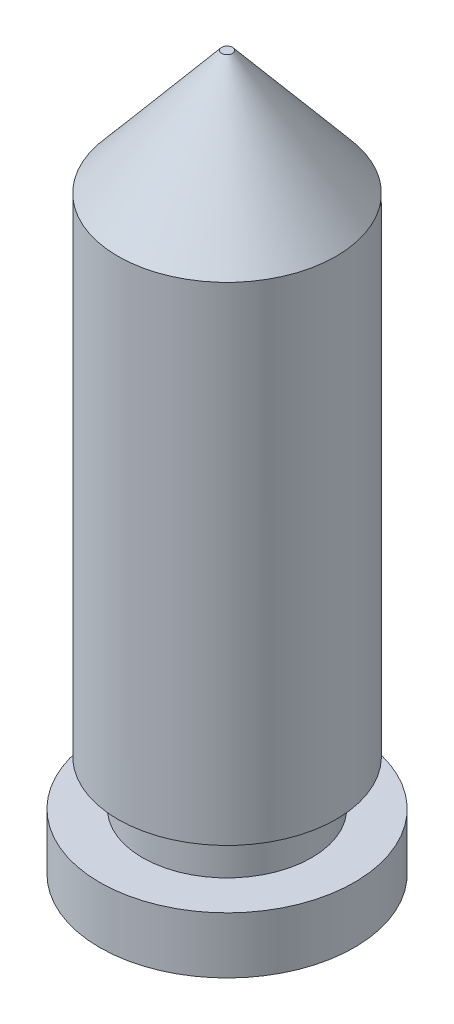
ISO-10303-21;
HEADER;
FILE_DESCRIPTION(('STEP AP214'),'2;1');
FILE_NAME('part.step','',(''),(''),'','','');
FILE_SCHEMA(('AUTOMOTIVE_DESIGN { 1 0 10303 214 1 1 1 1 }'));
ENDSEC;
DATA;
#1=APPLICATION_CONTEXT('core data for automotive mechanical design processes');
#2=APPLICATION_PROTOCOL_DEFINITION('international standard','automotive_design',2000,#1);
#3=PRODUCT_CONTEXT('',#1,'mechanical');
#4=PRODUCT('Part','Part','',(#3));
#5=PRODUCT_RELATED_PRODUCT_CATEGORY('part','',(#4));
#6=PRODUCT_DEFINITION_FORMATION('','',#4);
#7=PRODUCT_DEFINITION_CONTEXT('part definition',#1,'design');
#8=PRODUCT_DEFINITION('design','',#6,#7);
#9=PRODUCT_DEFINITION_SHAPE('','',#8);
#10=(LENGTH_UNIT() NAMED_UNIT(*) SI_UNIT(.MILLI.,.METRE.));
#11=(NAMED_UNIT(*) PLANE_ANGLE_UNIT() SI_UNIT($,.RADIAN.));
#12=(NAMED_UNIT(*) SI_UNIT($,.STERADIAN.) SOLID_ANGLE_UNIT());
#13=UNCERTAINTY_MEASURE_WITH_UNIT(LENGTH_MEASURE(1.E-05),#10,'distance_accuracy_value','');
#14=(GEOMETRIC_REPRESENTATION_CONTEXT(3) GLOBAL_UNCERTAINTY_ASSIGNED_CONTEXT((#13)) GLOBAL_UNIT_ASSIGNED_CONTEXT((#10,
#11,#12)) REPRESENTATION_CONTEXT('',''));
#15=CARTESIAN_POINT('',(0.,0.,0.));
#16=DIRECTION('',(0.,0.,1.));
#17=DIRECTION('',(1.,0.,0.));
#18=AXIS2_PLACEMENT_3D('',#15,#16,#17);
#19=CARTESIAN_POINT('',(0.,0.,0.));
#20=DIRECTION('',(0.,1.,0.));
#21=DIRECTION('',(0.,0.,1.));
#22=AXIS2_PLACEMENT_3D('',#19,#20,#21);
#23=PLANE('',#22);
#24=CARTESIAN_POINT('',(0.,0.,0.));
#25=DIRECTION('',(0.,1.,0.));
#26=DIRECTION('',(0.,0.,1.));
#27=AXIS2_PLACEMENT_3D('',#24,#25,#26);
#28=CIRCLE('',#27,1.778);
#29=CARTESIAN_POINT('',(0.,0.,1.778));
#30=VERTEX_POINT('',#29);
#31=EDGE_CURVE('E10',#30,#30,#28,.T.);
#32=ORIENTED_EDGE('',*,*,#31,.F.);
#33=EDGE_LOOP('',(#32));
#34=FACE_BOUND('',#33,.T.);
#35=ADVANCED_FACE('F32',(#34),#23,.F.);
#36=CARTESIAN_POINT('',(0.,0.,0.));
#37=DIRECTION('',(0.,1.,0.));
#38=DIRECTION('',(0.,0.,1.));
#39=AXIS2_PLACEMENT_3D('',#36,#37,#38);
#40=CYLINDRICAL_SURFACE('',#39,1.778);
#41=CARTESIAN_POINT('',(0.,0.7874,0.));
#42=DIRECTION('',(0.,1.,0.));
#43=DIRECTION('',(0.,0.,1.));
#44=AXIS2_PLACEMENT_3D('',#41,#42,#43);
#45=CIRCLE('',#44,1.778);
#46=CARTESIAN_POINT('',(0.,0.7874,1.778));
#47=VERTEX_POINT('',#46);
#48=EDGE_CURVE('E38',#47,#47,#45,.T.);
#49=ORIENTED_EDGE('',*,*,#48,.F.);
#50=EDGE_LOOP('',(#49));
#51=FACE_BOUND('',#50,.T.);
#52=ORIENTED_EDGE('',*,*,#31,.T.);
#53=EDGE_LOOP('',(#52));
#54=FACE_BOUND('',#53,.T.);
#55=ADVANCED_FACE('F89',(#51,#54),#40,.T.);
#56=CARTESIAN_POINT('',(1.778,0.7874,0.));
#57=DIRECTION('',(0.,-1.,0.));
#58=DIRECTION('',(0.,0.,-1.));
#59=AXIS2_PLACEMENT_3D('',#56,#57,#58);
#60=PLANE('',#59);
#61=CARTESIAN_POINT('',(0.,0.7874,0.));
#62=DIRECTION('',(0.,1.,0.));
#63=DIRECTION('',(0.,0.,1.));
#64=AXIS2_PLACEMENT_3D('',#61,#62,#63);
#65=CIRCLE('',#64,1.1811);
#66=CARTESIAN_POINT('',(0.,0.7874,1.1811));
#67=VERTEX_POINT('',#66);
#68=EDGE_CURVE('E42',#67,#67,#65,.T.);
#69=ORIENTED_EDGE('',*,*,#68,.F.);
#70=EDGE_LOOP('',(#69));
#71=FACE_BOUND('',#70,.T.);
#72=ORIENTED_EDGE('',*,*,#48,.T.);
#73=EDGE_LOOP('',(#72));
#74=FACE_BOUND('',#73,.T.);
#75=ADVANCED_FACE('F84',(#71,#74),#60,.F.);
#76=CARTESIAN_POINT('',(0.,0.,0.));
#77=DIRECTION('',(0.,1.,0.));
#78=DIRECTION('',(0.,0.,1.));
#79=AXIS2_PLACEMENT_3D('',#76,#77,#78);
#80=CYLINDRICAL_SURFACE('',#79,1.1811);
#81=CARTESIAN_POINT('',(0.,1.4224,0.));
#82=DIRECTION('',(0.,1.,0.));
#83=DIRECTION('',(0.,0.,1.));
#84=AXIS2_PLACEMENT_3D('',#81,#82,#83);
#85=CIRCLE('',#84,1.1811);
#86=CARTESIAN_POINT('',(0.,1.4224,1.1811));
#87=VERTEX_POINT('',#86);
#88=EDGE_CURVE('E46',#87,#87,#85,.T.);
#89=ORIENTED_EDGE('',*,*,#88,.F.);
#90=EDGE_LOOP('',(#89));
#91=FACE_BOUND('',#90,.T.);
#92=ORIENTED_EDGE('',*,*,#68,.T.);
#93=EDGE_LOOP('',(#92));
#94=FACE_BOUND('',#93,.T.);
#95=ADVANCED_FACE('F78',(#91,#94),#80,.T.);
#96=CARTESIAN_POINT('',(1.1811,1.4224,0.));
#97=DIRECTION('',(0.,1.,0.));
#98=DIRECTION('',(0.,0.,1.));
#99=AXIS2_PLACEMENT_3D('',#96,#97,#98);
#100=PLANE('',#99);
#101=CARTESIAN_POINT('',(0.,1.4224,0.));
#102=DIRECTION('',(0.,1.,0.));
#103=DIRECTION('',(0.,0.,1.));
#104=AXIS2_PLACEMENT_3D('',#101,#102,#103);
#105=CIRCLE('',#104,1.524);
#106=CARTESIAN_POINT('',(0.,1.4224,1.524));
#107=VERTEX_POINT('',#106);
#108=EDGE_CURVE('E51',#107,#107,#105,.T.);
#109=ORIENTED_EDGE('',*,*,#108,.F.);
#110=EDGE_LOOP('',(#109));
#111=FACE_BOUND('',#110,.T.);
#112=ORIENTED_EDGE('',*,*,#88,.T.);
#113=EDGE_LOOP('',(#112));
#114=FACE_BOUND('',#113,.T.);
#115=ADVANCED_FACE('F72',(#111,#114),#100,.F.);
#116=CARTESIAN_POINT('',(0.,0.,0.));
#117=DIRECTION('',(0.,1.,0.));
#118=DIRECTION('',(0.,0.,1.));
#119=AXIS2_PLACEMENT_3D('',#116,#117,#118);
#120=CYLINDRICAL_SURFACE('',#119,1.524);
#121=CARTESIAN_POINT('',(0.,8.2296,0.));
#122=DIRECTION('',(0.,1.,0.));
#123=DIRECTION('',(0.,0.,1.));
#124=AXIS2_PLACEMENT_3D('',#121,#122,#123);
#125=CIRCLE('',#124,1.524);
#126=CARTESIAN_POINT('',(0.,8.2296,-1.524));
#127=VERTEX_POINT('',#126);
#128=EDGE_CURVE('E54',#127,#127,#125,.T.);
#129=ORIENTED_EDGE('',*,*,#128,.F.);
#130=EDGE_LOOP('',(#129));
#131=FACE_BOUND('',#130,.T.);
#132=ORIENTED_EDGE('',*,*,#108,.T.);
#133=EDGE_LOOP('',(#132));
#134=FACE_BOUND('',#133,.T.);
#135=ADVANCED_FACE('F66',(#131,#134),#120,.T.);
#136=CARTESIAN_POINT('',(0.,8.2296,0.));
#137=DIRECTION('',(0.,-1.,0.));
#138=DIRECTION('',(0.,0.,-1.));
#139=AXIS2_PLACEMENT_3D('',#136,#137,#138);
#140=CONICAL_SURFACE('',#139,1.524,0.698131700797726);
#141=CARTESIAN_POINT('',(0.,9.9568,0.));
#142=DIRECTION('',(0.,1.,0.));
#143=DIRECTION('',(0.,0.,1.));
#144=AXIS2_PLACEMENT_3D('',#141,#142,#143);
#145=CIRCLE('',#144,0.0747071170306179);
#146=CARTESIAN_POINT('',(0.,9.9568,-0.0747071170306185));
#147=VERTEX_POINT('',#146);
#148=EDGE_CURVE('E57',#147,#147,#145,.T.);
#149=CARTESIAN_POINT('',(0.,9.9568,-0.0747071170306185));
#150=CARTESIAN_POINT('',(0.,9.93880833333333,-0.089803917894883));
#151=CARTESIAN_POINT('',(0.,9.92081666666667,-0.104900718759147));
#152=CARTESIAN_POINT('',(0.,9.88483333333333,-0.135094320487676));
#153=CARTESIAN_POINT('',(0.,9.86684166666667,-0.15019112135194));
#154=CARTESIAN_POINT('',(0.,9.83085833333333,-0.180384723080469));
#155=CARTESIAN_POINT('',(0.,9.81286666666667,-0.195481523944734));
#156=CARTESIAN_POINT('',(0.,9.77688333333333,-0.225675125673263));
#157=CARTESIAN_POINT('',(0.,9.75889166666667,-0.240771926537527));
#158=CARTESIAN_POINT('',(0.,9.72290833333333,-0.270965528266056));
#159=CARTESIAN_POINT('',(0.,9.70491666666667,-0.28606232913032));
#160=CARTESIAN_POINT('',(0.,9.66893333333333,-0.316255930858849));
#161=CARTESIAN_POINT('',(0.,9.65094166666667,-0.331352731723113));
#162=CARTESIAN_POINT('',(0.,9.61495833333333,-0.361546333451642));
#163=CARTESIAN_POINT('',(0.,9.59696666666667,-0.376643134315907));
#164=CARTESIAN_POINT('',(0.,9.56098333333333,-0.406836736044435));
#165=CARTESIAN_POINT('',(0.,9.54299166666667,-0.4219335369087));
#166=CARTESIAN_POINT('',(0.,9.50700833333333,-0.452127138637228));
#167=CARTESIAN_POINT('',(0.,9.48901666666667,-0.467223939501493));
#168=CARTESIAN_POINT('',(0.,9.45303333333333,-0.497417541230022));
#169=CARTESIAN_POINT('',(0.,9.43504166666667,-0.512514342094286));
#170=CARTESIAN_POINT('',(0.,9.39905833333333,-0.542707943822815));
#171=CARTESIAN_POINT('',(0.,9.38106666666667,-0.557804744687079));
#172=CARTESIAN_POINT('',(0.,9.34508333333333,-0.587998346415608));
#173=CARTESIAN_POINT('',(0.,9.32709166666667,-0.603095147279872));
#174=CARTESIAN_POINT('',(0.,9.29110833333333,-0.633288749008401));
#175=CARTESIAN_POINT('',(0.,9.27311666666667,-0.648385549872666));
#176=CARTESIAN_POINT('',(0.,9.23713333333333,-0.678579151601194));
#177=CARTESIAN_POINT('',(0.,9.21914166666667,-0.693675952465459));
#178=CARTESIAN_POINT('',(0.,9.18315833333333,-0.723869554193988));
#179=CARTESIAN_POINT('',(0.,9.16516666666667,-0.738966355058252));
#180=CARTESIAN_POINT('',(0.,9.12918333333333,-0.769159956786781));
#181=CARTESIAN_POINT('',(0.,9.11119166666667,-0.784256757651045));
#182=CARTESIAN_POINT('',(0.,9.07520833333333,-0.814450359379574));
#183=CARTESIAN_POINT('',(0.,9.05721666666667,-0.829547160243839));
#184=CARTESIAN_POINT('',(0.,9.02123333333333,-0.859740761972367));
#185=CARTESIAN_POINT('',(0.,9.00324166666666,-0.874837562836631));
#186=CARTESIAN_POINT('',(0.,8.96725833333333,-0.90503116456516));
#187=CARTESIAN_POINT('',(0.,8.94926666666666,-0.920127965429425));
#188=CARTESIAN_POINT('',(0.,8.91328333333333,-0.950321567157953));
#189=CARTESIAN_POINT('',(0.,8.89529166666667,-0.965418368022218));
#190=CARTESIAN_POINT('',(0.,8.85930833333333,-0.995611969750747));
#191=CARTESIAN_POINT('',(0.,8.84131666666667,-1.01070877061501));
#192=CARTESIAN_POINT('',(0.,8.80533333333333,-1.04090237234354));
#193=CARTESIAN_POINT('',(0.,8.78734166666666,-1.0559991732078));
#194=CARTESIAN_POINT('',(0.,8.75135833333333,-1.08619277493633));
#195=CARTESIAN_POINT('',(0.,8.73336666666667,-1.1012895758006));
#196=CARTESIAN_POINT('',(0.,8.69738333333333,-1.13148317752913));
#197=CARTESIAN_POINT('',(0.,8.67939166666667,-1.14657997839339));
#198=CARTESIAN_POINT('',(0.,8.64340833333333,-1.17677358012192));
#199=CARTESIAN_POINT('',(0.,8.62541666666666,-1.19187038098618));
#200=CARTESIAN_POINT('',(0.,8.58943333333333,-1.22206398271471));
#201=CARTESIAN_POINT('',(0.,8.57144166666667,-1.23716078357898));
#202=CARTESIAN_POINT('',(0.,8.53545833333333,-1.26735438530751));
#203=CARTESIAN_POINT('',(0.,8.51746666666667,-1.28245118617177));
#204=CARTESIAN_POINT('',(0.,8.48148333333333,-1.3126447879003));
#205=CARTESIAN_POINT('',(0.,8.46349166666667,-1.32774158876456));
#206=CARTESIAN_POINT('',(0.,8.42750833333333,-1.35793519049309));
#207=CARTESIAN_POINT('',(0.,8.40951666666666,-1.37303199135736));
#208=CARTESIAN_POINT('',(0.,8.37353333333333,-1.40322559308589));
#209=CARTESIAN_POINT('',(0.,8.35554166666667,-1.41832239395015));
#210=CARTESIAN_POINT('',(0.,8.31955833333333,-1.44851599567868));
#211=CARTESIAN_POINT('',(0.,8.30156666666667,-1.46361279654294));
#212=CARTESIAN_POINT('',(0.,8.26558333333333,-1.49380639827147));
#213=CARTESIAN_POINT('',(0.,8.24759166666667,-1.50890319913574));
#214=CARTESIAN_POINT('',(0.,8.2296,-1.524));
#215=B_SPLINE_CURVE_WITH_KNOTS('',3,(#149,#150,#151,#152,#153,#154,#155,#156,#157,#158,#159,
#160,#161,#162,#163,#164,#165,#166,#167,#168,#169,#170,#171,#172,#173,#174,#175,#176,#177,#178,
#179,#180,#181,#182,#183,#184,#185,#186,#187,#188,#189,#190,#191,#192,#193,#194,#195,#196,#197,
#198,#199,#200,#201,#202,#203,#204,#205,#206,#207,#208,#209,#210,#211,#212,#213,#214),
.UNSPECIFIED.,.F.,.F.,(4,2,2,2,2,2,2,2,2,2,2,2,2,2,2,2,2,2,2,2,2,2,2,2,2,2,2,2,2,2,2,2,4),(0.,
0.0704593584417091,0.140918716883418,0.211378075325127,0.281837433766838,0.352296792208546,
0.422756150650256,0.493215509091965,0.563674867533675,0.634134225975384,0.704593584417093,
0.775052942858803,0.845512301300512,0.915971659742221,0.98643101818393,1.05689037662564,
1.12734973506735,1.19780909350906,1.26826845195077,1.33872781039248,1.40918716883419,
1.4796465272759,1.55010588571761,1.62056524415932,1.69102460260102,1.76148396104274,
1.83194331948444,1.90240267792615,1.97286203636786,2.04332139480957,2.11378075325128,
2.18424011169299,2.2546994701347),.UNSPECIFIED.);
#216=EDGE_CURVE('BSEAM63',#147,#127,#215,.T.);
#217=ORIENTED_EDGE('',*,*,#148,.F.);
#218=ORIENTED_EDGE('',*,*,#128,.T.);
#219=ORIENTED_EDGE('',*,*,#216,.T.);
#220=ORIENTED_EDGE('',*,*,#216,.F.);
#221=EDGE_LOOP('',(#217,#219,#218,#220));
#222=FACE_BOUND('',#221,.T.);
#223=ADVANCED_FACE('F63',(#222),#140,.T.);
#224=CARTESIAN_POINT('',(0.0747071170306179,9.9568,0.));
#225=DIRECTION('',(0.,-1.,0.));
#226=DIRECTION('',(0.,0.,-1.));
#227=AXIS2_PLACEMENT_3D('',#224,#225,#226);
#228=PLANE('',#227);
#229=ORIENTED_EDGE('',*,*,#148,.T.);
#230=EDGE_LOOP('',(#229));
#231=FACE_BOUND('',#230,.T.);
#232=ADVANCED_FACE('F61',(#231),#228,.F.);
#233=CLOSED_SHELL('',(#35,#55,#75,#95,#115,#135,#223,#232));
#234=MANIFOLD_SOLID_BREP('B2',#233);
#235=ADVANCED_BREP_SHAPE_REPRESENTATION('',(#18,#234),#14);
#236=SHAPE_DEFINITION_REPRESENTATION(#9,#235);
ENDSEC;
END-ISO-10303-21;
